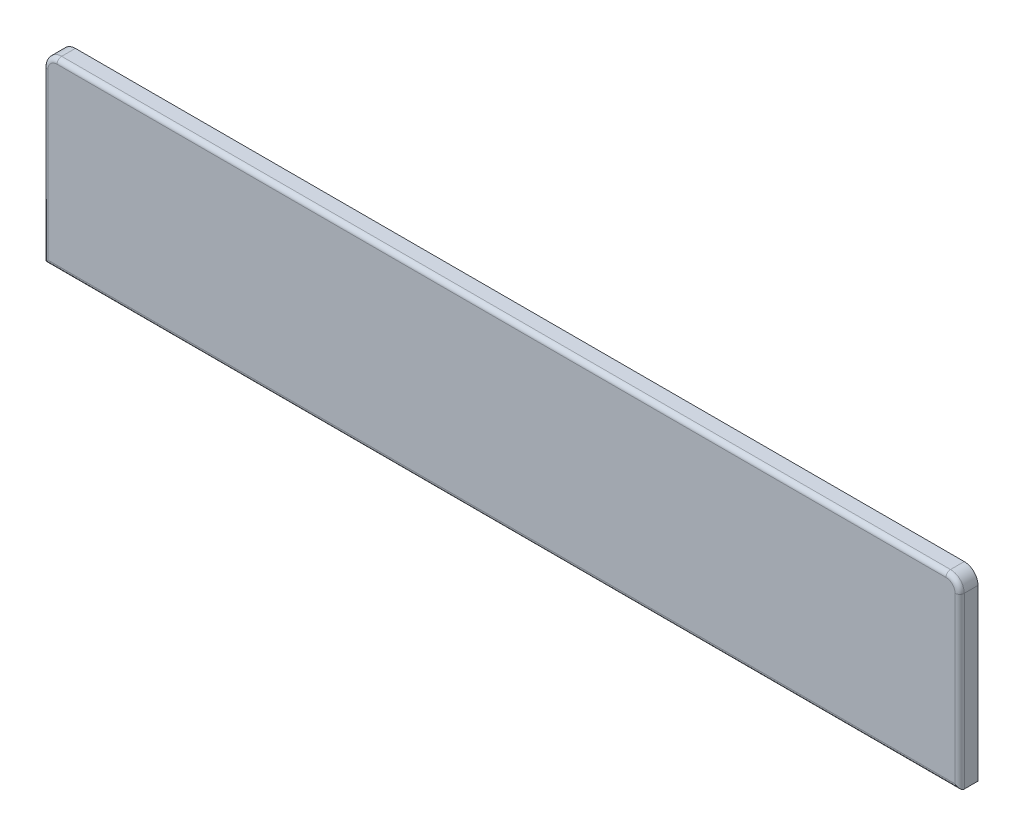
ISO-10303-21;
HEADER;
FILE_DESCRIPTION(('STEP AP214'),'2;1');
FILE_NAME('part.step','',(''),(''),'','','');
FILE_SCHEMA(('AUTOMOTIVE_DESIGN { 1 0 10303 214 1 1 1 1 }'));
ENDSEC;
DATA;
#1=APPLICATION_CONTEXT('core data for automotive mechanical design processes');
#2=APPLICATION_PROTOCOL_DEFINITION('international standard','automotive_design',2000,#1);
#3=PRODUCT_CONTEXT('',#1,'mechanical');
#4=PRODUCT('Part','Part','',(#3));
#5=PRODUCT_RELATED_PRODUCT_CATEGORY('part','',(#4));
#6=PRODUCT_DEFINITION_FORMATION('','',#4);
#7=PRODUCT_DEFINITION_CONTEXT('part definition',#1,'design');
#8=PRODUCT_DEFINITION('design','',#6,#7);
#9=PRODUCT_DEFINITION_SHAPE('','',#8);
#10=(LENGTH_UNIT() NAMED_UNIT(*) SI_UNIT(.MILLI.,.METRE.));
#11=(NAMED_UNIT(*) PLANE_ANGLE_UNIT() SI_UNIT($,.RADIAN.));
#12=(NAMED_UNIT(*) SI_UNIT($,.STERADIAN.) SOLID_ANGLE_UNIT());
#13=UNCERTAINTY_MEASURE_WITH_UNIT(LENGTH_MEASURE(1.E-05),#10,'distance_accuracy_value','');
#14=(GEOMETRIC_REPRESENTATION_CONTEXT(3) GLOBAL_UNCERTAINTY_ASSIGNED_CONTEXT((#13)) GLOBAL_UNIT_ASSIGNED_CONTEXT((#10,
#11,#12)) REPRESENTATION_CONTEXT('',''));
#15=CARTESIAN_POINT('',(0.,0.,0.));
#16=DIRECTION('',(0.,0.,1.));
#17=DIRECTION('',(1.,0.,0.));
#18=AXIS2_PLACEMENT_3D('',#15,#16,#17);
#19=CARTESIAN_POINT('',(0.,0.,40.));
#20=DIRECTION('',(-1.,0.,0.));
#21=DIRECTION('',(0.,-1.,0.));
#22=AXIS2_PLACEMENT_3D('',#19,#20,#21);
#23=PLANE('',#22);
#24=DIRECTION('',(0.,0.,-1.));
#25=VECTOR('',#24,1.);
#26=CARTESIAN_POINT('',(0.,-30.,40.));
#27=LINE('',#26,#25);
#28=CARTESIAN_POINT('',(0.,-30.,0.));
#29=VERTEX_POINT('',#28);
#30=CARTESIAN_POINT('',(0.,-30.,30.));
#31=VERTEX_POINT('',#30);
#32=EDGE_CURVE('E151',#29,#31,#27,.F.);
#33=ORIENTED_EDGE('',*,*,#32,.T.);
#34=DIRECTION('',(0.,1.,0.));
#35=VECTOR('',#34,1.);
#36=CARTESIAN_POINT('',(0.,0.,30.));
#37=LINE('',#36,#35);
#38=CARTESIAN_POINT('',(0.,-400.,30.));
#39=VERTEX_POINT('',#38);
#40=EDGE_CURVE('E11',#31,#39,#37,.F.);
#41=ORIENTED_EDGE('',*,*,#40,.T.);
#42=DIRECTION('',(0.,0.,-1.));
#43=VECTOR('',#42,1.);
#44=CARTESIAN_POINT('',(0.,-400.,40.));
#45=LINE('',#44,#43);
#46=CARTESIAN_POINT('',(0.,-400.,0.));
#47=VERTEX_POINT('',#46);
#48=EDGE_CURVE('E125',#39,#47,#45,.T.);
#49=ORIENTED_EDGE('',*,*,#48,.T.);
#50=DIRECTION('',(0.,1.,0.));
#51=VECTOR('',#50,1.);
#52=CARTESIAN_POINT('',(0.,0.,0.));
#53=LINE('',#52,#51);
#54=EDGE_CURVE('E139',#47,#29,#53,.T.);
#55=ORIENTED_EDGE('',*,*,#54,.T.);
#56=EDGE_LOOP('',(#33,#41,#49,#55));
#57=FACE_BOUND('',#56,.T.);
#58=ADVANCED_FACE('F40',(#57),#23,.F.);
#59=CARTESIAN_POINT('',(0.,0.,40.));
#60=DIRECTION('',(0.,-1.,0.));
#61=DIRECTION('',(0.,0.,-1.));
#62=AXIS2_PLACEMENT_3D('',#59,#60,#61);
#63=PLANE('',#62);
#64=DIRECTION('',(0.,0.,-1.));
#65=VECTOR('',#64,1.);
#66=CARTESIAN_POINT('',(-1970.,0.,40.));
#67=LINE('',#66,#65);
#68=CARTESIAN_POINT('',(-1970.,0.,0.));
#69=VERTEX_POINT('',#68);
#70=CARTESIAN_POINT('',(-1970.,0.,30.));
#71=VERTEX_POINT('',#70);
#72=EDGE_CURVE('E124',#69,#71,#67,.F.);
#73=ORIENTED_EDGE('',*,*,#72,.T.);
#74=DIRECTION('',(-1.,0.,0.));
#75=VECTOR('',#74,1.);
#76=CARTESIAN_POINT('',(0.,0.,30.));
#77=LINE('',#76,#75);
#78=CARTESIAN_POINT('',(-30.,0.,30.));
#79=VERTEX_POINT('',#78);
#80=EDGE_CURVE('E64',#71,#79,#77,.F.);
#81=ORIENTED_EDGE('',*,*,#80,.T.);
#82=DIRECTION('',(0.,0.,-1.));
#83=VECTOR('',#82,1.);
#84=CARTESIAN_POINT('',(-30.,0.,40.));
#85=LINE('',#84,#83);
#86=CARTESIAN_POINT('',(-30.,0.,0.));
#87=VERTEX_POINT('',#86);
#88=EDGE_CURVE('E145',#79,#87,#85,.T.);
#89=ORIENTED_EDGE('',*,*,#88,.T.);
#90=DIRECTION('',(-1.,0.,0.));
#91=VECTOR('',#90,1.);
#92=CARTESIAN_POINT('',(0.,0.,0.));
#93=LINE('',#92,#91);
#94=EDGE_CURVE('E134',#87,#69,#93,.T.);
#95=ORIENTED_EDGE('',*,*,#94,.T.);
#96=EDGE_LOOP('',(#73,#81,#89,#95));
#97=FACE_BOUND('',#96,.T.);
#98=ADVANCED_FACE('F197',(#97),#63,.F.);
#99=CARTESIAN_POINT('',(-2000.,0.,40.));
#100=DIRECTION('',(1.,0.,0.));
#101=DIRECTION('',(0.,0.,-1.));
#102=AXIS2_PLACEMENT_3D('',#99,#100,#101);
#103=PLANE('',#102);
#104=DIRECTION('',(0.,0.,-1.));
#105=VECTOR('',#104,1.);
#106=CARTESIAN_POINT('',(-2000.,-400.,40.));
#107=LINE('',#106,#105);
#108=CARTESIAN_POINT('',(-2000.,-400.,30.));
#109=VERTEX_POINT('',#108);
#110=CARTESIAN_POINT('',(-2000.,-400.,0.));
#111=VERTEX_POINT('',#110);
#112=EDGE_CURVE('E114',#109,#111,#107,.T.);
#113=ORIENTED_EDGE('',*,*,#112,.F.);
#114=DIRECTION('',(0.,-1.,0.));
#115=VECTOR('',#114,1.);
#116=CARTESIAN_POINT('',(-2000.,0.,30.));
#117=LINE('',#116,#115);
#118=CARTESIAN_POINT('',(-2000.,-30.,30.));
#119=VERTEX_POINT('',#118);
#120=EDGE_CURVE('E168',#109,#119,#117,.F.);
#121=ORIENTED_EDGE('',*,*,#120,.T.);
#122=DIRECTION('',(0.,0.,-1.));
#123=VECTOR('',#122,1.);
#124=CARTESIAN_POINT('',(-2000.,-30.,40.));
#125=LINE('',#124,#123);
#126=CARTESIAN_POINT('',(-2000.,-30.,0.));
#127=VERTEX_POINT('',#126);
#128=EDGE_CURVE('E131',#119,#127,#125,.T.);
#129=ORIENTED_EDGE('',*,*,#128,.T.);
#130=DIRECTION('',(0.,-1.,0.));
#131=VECTOR('',#130,1.);
#132=CARTESIAN_POINT('',(-2000.,0.,0.));
#133=LINE('',#132,#131);
#134=EDGE_CURVE('E128',#127,#111,#133,.T.);
#135=ORIENTED_EDGE('',*,*,#134,.T.);
#136=EDGE_LOOP('',(#113,#121,#129,#135));
#137=FACE_BOUND('',#136,.T.);
#138=ADVANCED_FACE('F129',(#137),#103,.F.);
#139=CARTESIAN_POINT('',(0.,-400.,40.));
#140=DIRECTION('',(0.,1.,0.));
#141=DIRECTION('',(-1.,0.,0.));
#142=AXIS2_PLACEMENT_3D('',#139,#140,#141);
#143=PLANE('',#142);
#144=ORIENTED_EDGE('',*,*,#48,.F.);
#145=DIRECTION('',(1.,0.,0.));
#146=VECTOR('',#145,1.);
#147=CARTESIAN_POINT('',(0.,-400.,30.));
#148=LINE('',#147,#146);
#149=EDGE_CURVE('E122',#39,#109,#148,.F.);
#150=ORIENTED_EDGE('',*,*,#149,.T.);
#151=ORIENTED_EDGE('',*,*,#112,.T.);
#152=DIRECTION('',(1.,0.,0.));
#153=VECTOR('',#152,1.);
#154=CARTESIAN_POINT('',(0.,-400.,0.));
#155=LINE('',#154,#153);
#156=EDGE_CURVE('E119',#111,#47,#155,.T.);
#157=ORIENTED_EDGE('',*,*,#156,.T.);
#158=EDGE_LOOP('',(#144,#150,#151,#157));
#159=FACE_BOUND('',#158,.T.);
#160=ADVANCED_FACE('F117',(#159),#143,.F.);
#161=CARTESIAN_POINT('',(0.,0.,40.));
#162=DIRECTION('',(0.,0.,-1.));
#163=DIRECTION('',(-1.,0.,0.));
#164=AXIS2_PLACEMENT_3D('',#161,#162,#163);
#165=PLANE('',#164);
#166=DIRECTION('',(0.,-1.,0.));
#167=VECTOR('',#166,1.);
#168=CARTESIAN_POINT('',(-1990.,0.,40.));
#169=LINE('',#168,#167);
#170=CARTESIAN_POINT('',(-1990.,-30.,40.));
#171=VERTEX_POINT('',#170);
#172=CARTESIAN_POINT('',(-1990.,-390.,40.));
#173=VERTEX_POINT('',#172);
#174=EDGE_CURVE('E162',#171,#173,#169,.T.);
#175=ORIENTED_EDGE('',*,*,#174,.T.);
#176=DIRECTION('',(1.,0.,0.));
#177=VECTOR('',#176,1.);
#178=CARTESIAN_POINT('',(0.,-390.,40.));
#179=LINE('',#178,#177);
#180=CARTESIAN_POINT('',(-9.99999999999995,-390.,40.));
#181=VERTEX_POINT('',#180);
#182=EDGE_CURVE('E164',#173,#181,#179,.T.);
#183=ORIENTED_EDGE('',*,*,#182,.T.);
#184=DIRECTION('',(0.,1.,0.));
#185=VECTOR('',#184,1.);
#186=CARTESIAN_POINT('',(-10.,0.,40.));
#187=LINE('',#186,#185);
#188=CARTESIAN_POINT('',(-9.99999999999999,-30.,40.));
#189=VERTEX_POINT('',#188);
#190=EDGE_CURVE('E154',#181,#189,#187,.T.);
#191=ORIENTED_EDGE('',*,*,#190,.T.);
#192=CARTESIAN_POINT('',(-30.,-30.,40.));
#193=DIRECTION('',(0.,0.,-1.));
#194=DIRECTION('',(-1.,0.,0.));
#195=AXIS2_PLACEMENT_3D('',#192,#193,#194);
#196=CIRCLE('',#195,20.);
#197=CARTESIAN_POINT('',(-30.,-10.,40.));
#198=VERTEX_POINT('',#197);
#199=EDGE_CURVE('E156',#189,#198,#196,.F.);
#200=ORIENTED_EDGE('',*,*,#199,.T.);
#201=DIRECTION('',(-1.,0.,0.));
#202=VECTOR('',#201,1.);
#203=CARTESIAN_POINT('',(0.,-10.,40.));
#204=LINE('',#203,#202);
#205=CARTESIAN_POINT('',(-1970.,-10.,40.));
#206=VERTEX_POINT('',#205);
#207=EDGE_CURVE('E158',#198,#206,#204,.T.);
#208=ORIENTED_EDGE('',*,*,#207,.T.);
#209=CARTESIAN_POINT('',(-1970.,-30.,40.));
#210=DIRECTION('',(0.,0.,-1.));
#211=DIRECTION('',(-1.,0.,0.));
#212=AXIS2_PLACEMENT_3D('',#209,#210,#211);
#213=CIRCLE('',#212,20.);
#214=EDGE_CURVE('E160',#206,#171,#213,.F.);
#215=ORIENTED_EDGE('',*,*,#214,.T.);
#216=EDGE_LOOP('',(#175,#183,#191,#200,#208,#215));
#217=FACE_BOUND('',#216,.T.);
#218=ADVANCED_FACE('F210',(#217),#165,.F.);
#219=CARTESIAN_POINT('',(0.,0.,0.));
#220=DIRECTION('',(0.,0.,-1.));
#221=DIRECTION('',(-1.,0.,0.));
#222=AXIS2_PLACEMENT_3D('',#219,#220,#221);
#223=PLANE('',#222);
#224=ORIENTED_EDGE('',*,*,#94,.F.);
#225=CARTESIAN_POINT('',(-30.,-30.,0.));
#226=DIRECTION('',(0.,0.,-1.));
#227=DIRECTION('',(-1.,0.,0.));
#228=AXIS2_PLACEMENT_3D('',#225,#226,#227);
#229=CIRCLE('',#228,30.);
#230=EDGE_CURVE('E149',#87,#29,#229,.T.);
#231=ORIENTED_EDGE('',*,*,#230,.T.);
#232=ORIENTED_EDGE('',*,*,#54,.F.);
#233=ORIENTED_EDGE('',*,*,#156,.F.);
#234=ORIENTED_EDGE('',*,*,#134,.F.);
#235=CARTESIAN_POINT('',(-1970.,-30.,0.));
#236=DIRECTION('',(0.,0.,-1.));
#237=DIRECTION('',(-1.,0.,0.));
#238=AXIS2_PLACEMENT_3D('',#235,#236,#237);
#239=CIRCLE('',#238,30.);
#240=EDGE_CURVE('E147',#127,#69,#239,.T.);
#241=ORIENTED_EDGE('',*,*,#240,.T.);
#242=EDGE_LOOP('',(#224,#231,#232,#233,#234,#241));
#243=FACE_BOUND('',#242,.T.);
#244=ADVANCED_FACE('F137',(#243),#223,.T.);
#245=CARTESIAN_POINT('',(-30.,-30.,40.));
#246=DIRECTION('',(0.,0.,-1.));
#247=DIRECTION('',(-1.,0.,0.));
#248=AXIS2_PLACEMENT_3D('',#245,#246,#247);
#249=CYLINDRICAL_SURFACE('',#248,30.);
#250=ORIENTED_EDGE('',*,*,#88,.F.);
#251=CARTESIAN_POINT('',(-30.,-30.,30.));
#252=DIRECTION('',(0.,0.,-1.));
#253=DIRECTION('',(-1.,0.,0.));
#254=AXIS2_PLACEMENT_3D('',#251,#252,#253);
#255=CIRCLE('',#254,30.);
#256=EDGE_CURVE('E49',#79,#31,#255,.T.);
#257=ORIENTED_EDGE('',*,*,#256,.T.);
#258=ORIENTED_EDGE('',*,*,#32,.F.);
#259=ORIENTED_EDGE('',*,*,#230,.F.);
#260=EDGE_LOOP('',(#250,#257,#258,#259));
#261=FACE_BOUND('',#260,.T.);
#262=ADVANCED_FACE('F237',(#261),#249,.T.);
#263=CARTESIAN_POINT('',(-1970.,-30.,40.));
#264=DIRECTION('',(0.,0.,-1.));
#265=DIRECTION('',(-1.,0.,0.));
#266=AXIS2_PLACEMENT_3D('',#263,#264,#265);
#267=CYLINDRICAL_SURFACE('',#266,30.);
#268=ORIENTED_EDGE('',*,*,#128,.F.);
#269=CARTESIAN_POINT('',(-1970.,-30.,30.));
#270=DIRECTION('',(0.,0.,-1.));
#271=DIRECTION('',(-1.,0.,0.));
#272=AXIS2_PLACEMENT_3D('',#269,#270,#271);
#273=CIRCLE('',#272,30.);
#274=EDGE_CURVE('E170',#119,#71,#273,.T.);
#275=ORIENTED_EDGE('',*,*,#274,.T.);
#276=ORIENTED_EDGE('',*,*,#72,.F.);
#277=ORIENTED_EDGE('',*,*,#240,.F.);
#278=EDGE_LOOP('',(#268,#275,#276,#277));
#279=FACE_BOUND('',#278,.T.);
#280=ADVANCED_FACE('F200',(#279),#267,.T.);
#281=CARTESIAN_POINT('',(0.,-10.,30.));
#282=DIRECTION('',(-1.,0.,0.));
#283=DIRECTION('',(0.,0.,1.));
#284=AXIS2_PLACEMENT_3D('',#281,#282,#283);
#285=CYLINDRICAL_SURFACE('',#284,10.);
#286=CARTESIAN_POINT('',(-30.,-10.,30.));
#287=DIRECTION('',(1.,0.,0.));
#288=DIRECTION('',(0.,0.,-1.));
#289=AXIS2_PLACEMENT_3D('',#286,#287,#288);
#290=CIRCLE('',#289,10.);
#291=EDGE_CURVE('E183',#79,#198,#290,.T.);
#292=ORIENTED_EDGE('',*,*,#291,.F.);
#293=ORIENTED_EDGE('',*,*,#80,.F.);
#294=CARTESIAN_POINT('',(-1970.,-10.,30.));
#295=DIRECTION('',(-1.,0.,0.));
#296=DIRECTION('',(0.,0.,1.));
#297=AXIS2_PLACEMENT_3D('',#294,#295,#296);
#298=CIRCLE('',#297,10.);
#299=EDGE_CURVE('E44',#206,#71,#298,.T.);
#300=ORIENTED_EDGE('',*,*,#299,.F.);
#301=ORIENTED_EDGE('',*,*,#207,.F.);
#302=EDGE_LOOP('',(#292,#293,#300,#301));
#303=FACE_BOUND('',#302,.T.);
#304=ADVANCED_FACE('F42',(#303),#285,.T.);
#305=CARTESIAN_POINT('',(-1970.,-30.,30.));
#306=DIRECTION('',(0.,0.,-1.));
#307=DIRECTION('',(-1.,0.,0.));
#308=AXIS2_PLACEMENT_3D('',#305,#306,#307);
#309=TOROIDAL_SURFACE('',#308,20.,10.);
#310=ORIENTED_EDGE('',*,*,#299,.T.);
#311=ORIENTED_EDGE('',*,*,#274,.F.);
#312=CARTESIAN_POINT('',(-1990.,-30.,30.));
#313=DIRECTION('',(0.,-1.,0.));
#314=DIRECTION('',(0.,0.,-1.));
#315=AXIS2_PLACEMENT_3D('',#312,#313,#314);
#316=CIRCLE('',#315,10.);
#317=EDGE_CURVE('E181',#171,#119,#316,.T.);
#318=ORIENTED_EDGE('',*,*,#317,.F.);
#319=ORIENTED_EDGE('',*,*,#214,.F.);
#320=EDGE_LOOP('',(#310,#311,#318,#319));
#321=FACE_BOUND('',#320,.T.);
#322=ADVANCED_FACE('F202',(#321),#309,.T.);
#323=CARTESIAN_POINT('',(-30.,-30.,30.));
#324=DIRECTION('',(0.,0.,-1.));
#325=DIRECTION('',(-1.,0.,0.));
#326=AXIS2_PLACEMENT_3D('',#323,#324,#325);
#327=TOROIDAL_SURFACE('',#326,20.,10.);
#328=ORIENTED_EDGE('',*,*,#291,.T.);
#329=ORIENTED_EDGE('',*,*,#199,.F.);
#330=CARTESIAN_POINT('',(-9.99999999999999,-30.,30.));
#331=DIRECTION('',(0.,-1.,0.));
#332=DIRECTION('',(0.,0.,-1.));
#333=AXIS2_PLACEMENT_3D('',#330,#331,#332);
#334=CIRCLE('',#333,10.);
#335=EDGE_CURVE('E178',#31,#189,#334,.T.);
#336=ORIENTED_EDGE('',*,*,#335,.F.);
#337=ORIENTED_EDGE('',*,*,#256,.F.);
#338=EDGE_LOOP('',(#328,#329,#336,#337));
#339=FACE_BOUND('',#338,.T.);
#340=ADVANCED_FACE('F214',(#339),#327,.T.);
#341=CARTESIAN_POINT('',(-1990.,0.,30.));
#342=DIRECTION('',(0.,-1.,0.));
#343=DIRECTION('',(0.,0.,-1.));
#344=AXIS2_PLACEMENT_3D('',#341,#342,#343);
#345=CYLINDRICAL_SURFACE('',#344,10.);
#346=ORIENTED_EDGE('',*,*,#317,.T.);
#347=ORIENTED_EDGE('',*,*,#120,.F.);
#348=CARTESIAN_POINT('',(-1990.,-390.,30.));
#349=DIRECTION('',(0.707106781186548,-0.707106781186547,0.));
#350=DIRECTION('',(-0.707106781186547,-0.707106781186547,0.));
#351=AXIS2_PLACEMENT_3D('',#348,#349,#350);
#352=ELLIPSE('',#351,14.1421356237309,10.);
#353=EDGE_CURVE('E176',#173,#109,#352,.T.);
#354=ORIENTED_EDGE('',*,*,#353,.F.);
#355=ORIENTED_EDGE('',*,*,#174,.F.);
#356=EDGE_LOOP('',(#346,#347,#354,#355));
#357=FACE_BOUND('',#356,.T.);
#358=ADVANCED_FACE('F206',(#357),#345,.T.);
#359=CARTESIAN_POINT('',(-10.,0.,30.));
#360=DIRECTION('',(0.,1.,0.));
#361=DIRECTION('',(-1.,0.,0.));
#362=AXIS2_PLACEMENT_3D('',#359,#360,#361);
#363=CYLINDRICAL_SURFACE('',#362,10.);
#364=ORIENTED_EDGE('',*,*,#335,.T.);
#365=ORIENTED_EDGE('',*,*,#190,.F.);
#366=CARTESIAN_POINT('',(-9.99999999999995,-390.,30.));
#367=DIRECTION('',(0.707106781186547,0.707106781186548,0.));
#368=DIRECTION('',(-0.707106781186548,0.707106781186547,0.));
#369=AXIS2_PLACEMENT_3D('',#366,#367,#368);
#370=ELLIPSE('',#369,14.1421356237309,10.);
#371=EDGE_CURVE('E174',#39,#181,#370,.F.);
#372=ORIENTED_EDGE('',*,*,#371,.F.);
#373=ORIENTED_EDGE('',*,*,#40,.F.);
#374=EDGE_LOOP('',(#364,#365,#372,#373));
#375=FACE_BOUND('',#374,.T.);
#376=ADVANCED_FACE('F219',(#375),#363,.T.);
#377=CARTESIAN_POINT('',(0.,-390.,30.));
#378=DIRECTION('',(1.,0.,0.));
#379=DIRECTION('',(0.,1.,0.));
#380=AXIS2_PLACEMENT_3D('',#377,#378,#379);
#381=CYLINDRICAL_SURFACE('',#380,10.);
#382=ORIENTED_EDGE('',*,*,#353,.T.);
#383=ORIENTED_EDGE('',*,*,#149,.F.);
#384=ORIENTED_EDGE('',*,*,#371,.T.);
#385=ORIENTED_EDGE('',*,*,#182,.F.);
#386=EDGE_LOOP('',(#382,#383,#384,#385));
#387=FACE_BOUND('',#386,.T.);
#388=ADVANCED_FACE('F221',(#387),#381,.T.);
#389=CLOSED_SHELL('',(#58,#98,#138,#160,#218,#244,#262,#280,#304,#322,#340,#358,#376,#388));
#390=MANIFOLD_SOLID_BREP('B2',#389);
#391=ADVANCED_BREP_SHAPE_REPRESENTATION('',(#18,#390),#14);
#392=SHAPE_DEFINITION_REPRESENTATION(#9,#391);
ENDSEC;
END-ISO-10303-21;
